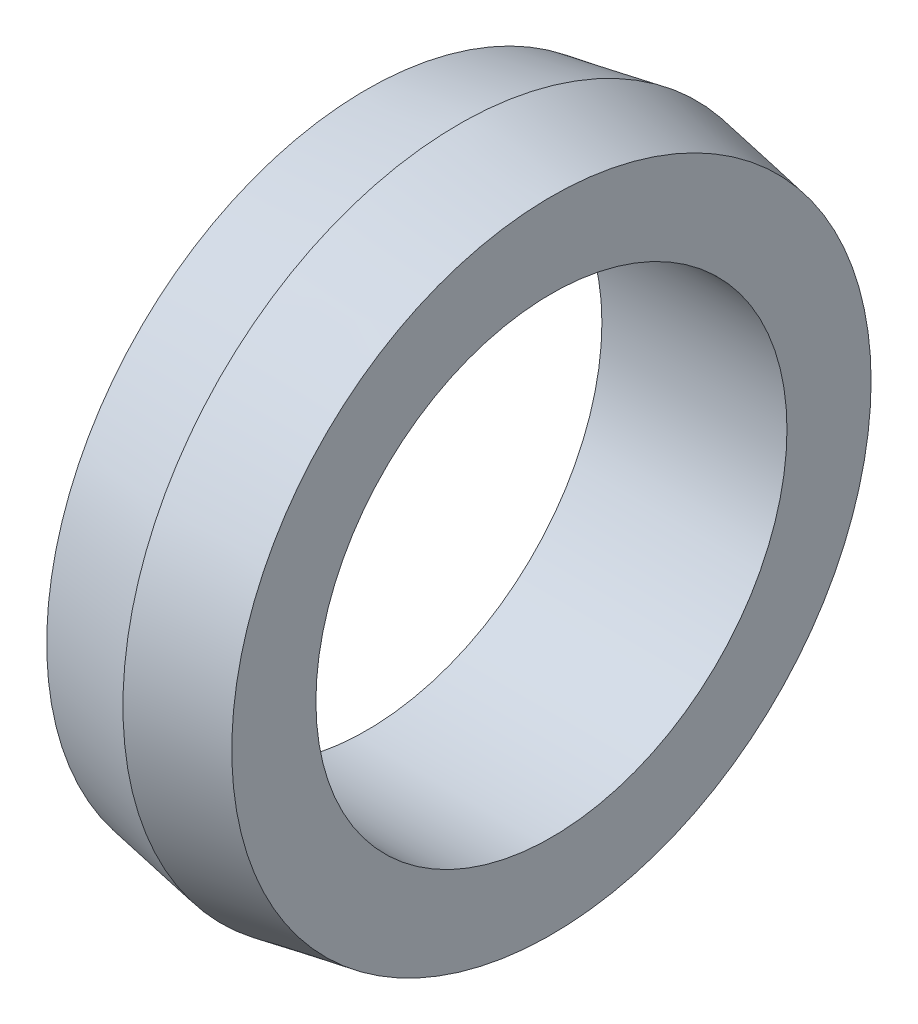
ISO-10303-21;
HEADER;
FILE_DESCRIPTION(('STEP AP214'),'2;1');
FILE_NAME('part.step','',(''),(''),'','','');
FILE_SCHEMA(('AUTOMOTIVE_DESIGN { 1 0 10303 214 1 1 1 1 }'));
ENDSEC;
DATA;
#1=APPLICATION_CONTEXT('core data for automotive mechanical design processes');
#2=APPLICATION_PROTOCOL_DEFINITION('international standard','automotive_design',2000,#1);
#3=PRODUCT_CONTEXT('',#1,'mechanical');
#4=PRODUCT('Part','Part','',(#3));
#5=PRODUCT_RELATED_PRODUCT_CATEGORY('part','',(#4));
#6=PRODUCT_DEFINITION_FORMATION('','',#4);
#7=PRODUCT_DEFINITION_CONTEXT('part definition',#1,'design');
#8=PRODUCT_DEFINITION('design','',#6,#7);
#9=PRODUCT_DEFINITION_SHAPE('','',#8);
#10=(LENGTH_UNIT() NAMED_UNIT(*) SI_UNIT(.MILLI.,.METRE.));
#11=(NAMED_UNIT(*) PLANE_ANGLE_UNIT() SI_UNIT($,.RADIAN.));
#12=(NAMED_UNIT(*) SI_UNIT($,.STERADIAN.) SOLID_ANGLE_UNIT());
#13=UNCERTAINTY_MEASURE_WITH_UNIT(LENGTH_MEASURE(1.E-05),#10,'distance_accuracy_value','');
#14=(GEOMETRIC_REPRESENTATION_CONTEXT(3) GLOBAL_UNCERTAINTY_ASSIGNED_CONTEXT((#13)) GLOBAL_UNIT_ASSIGNED_CONTEXT((#10,
#11,#12)) REPRESENTATION_CONTEXT('',''));
#15=CARTESIAN_POINT('',(0.,0.,0.));
#16=DIRECTION('',(0.,0.,1.));
#17=DIRECTION('',(1.,0.,0.));
#18=AXIS2_PLACEMENT_3D('',#15,#16,#17);
#19=CARTESIAN_POINT('',(-16.5,42.,0.));
#20=DIRECTION('',(-1.,0.,0.));
#21=DIRECTION('',(0.,0.,1.));
#22=AXIS2_PLACEMENT_3D('',#19,#20,#21);
#23=PLANE('',#22);
#24=CARTESIAN_POINT('',(-16.5,0.,0.));
#25=DIRECTION('',(1.,0.,0.));
#26=DIRECTION('',(0.,0.,-1.));
#27=AXIS2_PLACEMENT_3D('',#24,#25,#26);
#28=CIRCLE('',#27,42.);
#29=CARTESIAN_POINT('',(-16.5,0.,-42.));
#30=VERTEX_POINT('',#29);
#31=EDGE_CURVE('E49',#30,#30,#28,.T.);
#32=ORIENTED_EDGE('',*,*,#31,.T.);
#33=EDGE_LOOP('',(#32));
#34=FACE_BOUND('',#33,.T.);
#35=CARTESIAN_POINT('',(-16.5,0.,0.));
#36=DIRECTION('',(1.,0.,0.));
#37=DIRECTION('',(0.,0.,-1.));
#38=AXIS2_PLACEMENT_3D('',#35,#36,#37);
#39=CIRCLE('',#38,57.);
#40=CARTESIAN_POINT('',(-16.5,0.,-57.));
#41=VERTEX_POINT('',#40);
#42=EDGE_CURVE('E10',#41,#41,#39,.T.);
#43=ORIENTED_EDGE('',*,*,#42,.F.);
#44=EDGE_LOOP('',(#43));
#45=FACE_BOUND('',#44,.T.);
#46=ADVANCED_FACE('F30',(#34,#45),#23,.T.);
#47=CARTESIAN_POINT('',(0.,0.,0.));
#48=DIRECTION('',(1.,0.,0.));
#49=DIRECTION('',(0.,0.,-1.));
#50=AXIS2_PLACEMENT_3D('',#47,#48,#49);
#51=CONICAL_SURFACE('',#50,59.9093951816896,0.174532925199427);
#52=ORIENTED_EDGE('',*,*,#42,.T.);
#53=EDGE_LOOP('',(#52));
#54=FACE_BOUND('',#53,.T.);
#55=CARTESIAN_POINT('',(0.,0.,0.));
#56=DIRECTION('',(1.,0.,0.));
#57=DIRECTION('',(0.,0.,-1.));
#58=AXIS2_PLACEMENT_3D('',#55,#56,#57);
#59=CIRCLE('',#58,59.9093951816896);
#60=CARTESIAN_POINT('',(0.,0.,-59.9093951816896));
#61=VERTEX_POINT('',#60);
#62=EDGE_CURVE('E36',#61,#61,#59,.T.);
#63=ORIENTED_EDGE('',*,*,#62,.F.);
#64=EDGE_LOOP('',(#63));
#65=FACE_BOUND('',#64,.T.);
#66=ADVANCED_FACE('F67',(#54,#65),#51,.T.);
#67=CARTESIAN_POINT('',(16.5,0.,0.));
#68=DIRECTION('',(-1.,0.,0.));
#69=DIRECTION('',(0.,0.,1.));
#70=AXIS2_PLACEMENT_3D('',#67,#68,#69);
#71=CONICAL_SURFACE('',#70,57.,0.174532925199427);
#72=ORIENTED_EDGE('',*,*,#62,.T.);
#73=EDGE_LOOP('',(#72));
#74=FACE_BOUND('',#73,.T.);
#75=CARTESIAN_POINT('',(16.5,0.,0.));
#76=DIRECTION('',(1.,0.,0.));
#77=DIRECTION('',(0.,0.,-1.));
#78=AXIS2_PLACEMENT_3D('',#75,#76,#77);
#79=CIRCLE('',#78,57.);
#80=CARTESIAN_POINT('',(16.5,0.,-57.));
#81=VERTEX_POINT('',#80);
#82=EDGE_CURVE('E40',#81,#81,#79,.T.);
#83=ORIENTED_EDGE('',*,*,#82,.F.);
#84=EDGE_LOOP('',(#83));
#85=FACE_BOUND('',#84,.T.);
#86=ADVANCED_FACE('F63',(#74,#85),#71,.T.);
#87=CARTESIAN_POINT('',(16.5,42.,0.));
#88=DIRECTION('',(1.,0.,0.));
#89=DIRECTION('',(0.,0.,-1.));
#90=AXIS2_PLACEMENT_3D('',#87,#88,#89);
#91=PLANE('',#90);
#92=ORIENTED_EDGE('',*,*,#82,.T.);
#93=EDGE_LOOP('',(#92));
#94=FACE_BOUND('',#93,.T.);
#95=CARTESIAN_POINT('',(16.5,0.,0.));
#96=DIRECTION('',(1.,0.,0.));
#97=DIRECTION('',(0.,0.,-1.));
#98=AXIS2_PLACEMENT_3D('',#95,#96,#97);
#99=CIRCLE('',#98,42.);
#100=CARTESIAN_POINT('',(16.5,0.,-42.));
#101=VERTEX_POINT('',#100);
#102=EDGE_CURVE('E44',#101,#101,#99,.T.);
#103=ORIENTED_EDGE('',*,*,#102,.F.);
#104=EDGE_LOOP('',(#103));
#105=FACE_BOUND('',#104,.T.);
#106=ADVANCED_FACE('F57',(#94,#105),#91,.T.);
#107=CARTESIAN_POINT('',(0.,0.,0.));
#108=DIRECTION('',(1.,0.,0.));
#109=DIRECTION('',(0.,0.,-1.));
#110=AXIS2_PLACEMENT_3D('',#107,#108,#109);
#111=CYLINDRICAL_SURFACE('',#110,42.);
#112=ORIENTED_EDGE('',*,*,#102,.T.);
#113=EDGE_LOOP('',(#112));
#114=FACE_BOUND('',#113,.T.);
#115=ORIENTED_EDGE('',*,*,#31,.F.);
#116=EDGE_LOOP('',(#115));
#117=FACE_BOUND('',#116,.T.);
#118=ADVANCED_FACE('F55',(#114,#117),#111,.F.);
#119=CLOSED_SHELL('',(#46,#66,#86,#106,#118));
#120=MANIFOLD_SOLID_BREP('B2',#119);
#121=ADVANCED_BREP_SHAPE_REPRESENTATION('',(#18,#120),#14);
#122=SHAPE_DEFINITION_REPRESENTATION(#9,#121);
ENDSEC;
END-ISO-10303-21;
